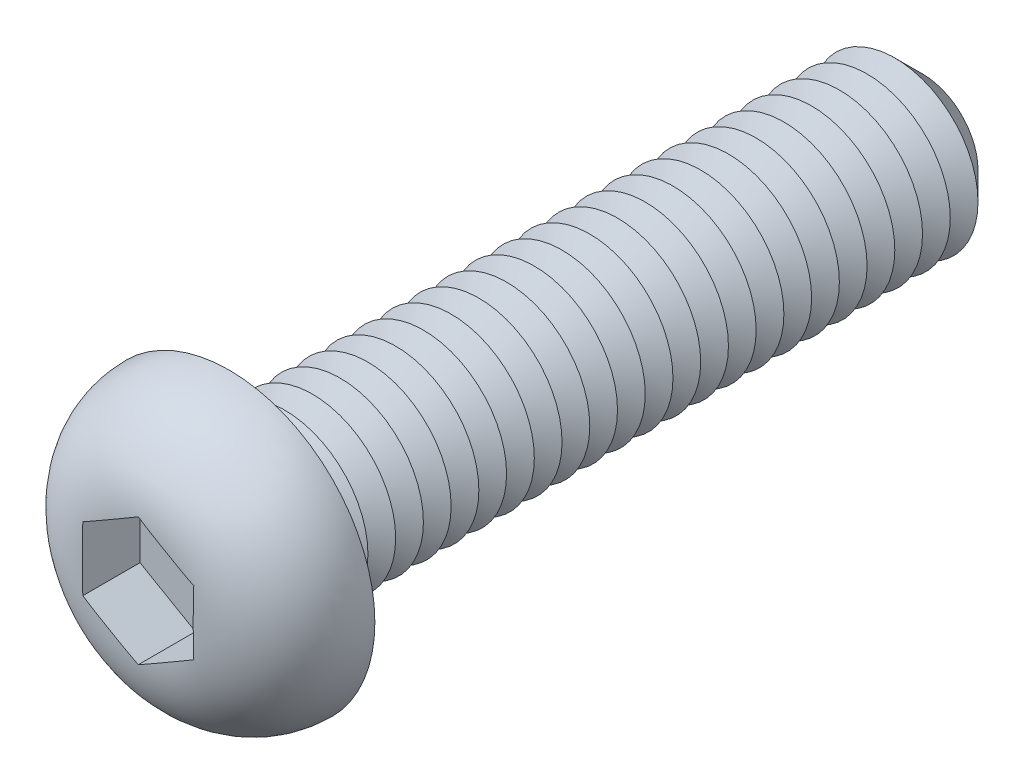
from build123d import *

# Parameters (mm, degrees)
CUT_EXTRUDE1_DEPTH  = 2.08
SKETCH4_R           = 3
BOSS_EXTRUDE1_DEPTH = 25
CHAMFER1_SIZE       = 1
LPATTERN1_COUNT     = 23
LPATTERN1_PITCH     = 1
FILLET2_R           = 0.5
SKETCH6_R           = 0.8
CUT_EXTRUDE2_DEPTH  = 26.22


with BuildPart() as part:
    # Sketch2 → Revolve1 (revolve)
    with BuildSketch(Plane(origin=(0, 0, 0), x_dir=(0, 0, -1), z_dir=(1, 0, 0)), mode=Mode.PRIVATE) as revolve1_sk:
        with BuildLine():
            Line((0, 0), (-3.3, 0))
            Line((-3.3, 0), (-3.3, 1.95))
            ThreePointArc((-3.3, 1.95), (-2.333452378, 4.283452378), (0, 5.25))
            Line((0, 5.25), (0, 0))
        make_face()
    revolve(revolve1_sk.sketch.rotate(Axis((0, 0, 47.934239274), (0, 0, -1)), 90), axis=Axis((0, 0, 47.934239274), (0, 0, -1)))

    # Sketch3 → Cut-Extrude1 (cut)
    with BuildSketch(Plane.XY.offset(3.3)):
        Polygon((0, 2.309401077), (-2, 1.154700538), (-2, -1.154700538), (0, -2.309401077), (2, -1.154700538), (2, 1.154700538), align=None)
    extrude(amount=-CUT_EXTRUDE1_DEPTH, mode=Mode.SUBTRACT)

    # Sketch4 → Boss-Extrude1 (add)
    with BuildSketch(Plane(origin=(0, 0, 0), x_dir=(-1, 0, 0), z_dir=(0, 0, -1))):
        with Locations(Location((0, 0, 0), (0, 0, 180))):
            Circle(SKETCH4_R)
    extrude(amount=BOSS_EXTRUDE1_DEPTH)

    # Chamfer1
    chamfer1_edges = [part.edges().sort_by_distance(p)[0] for p in [
        (-3, 0, -25),
    ]]
    chamfer(chamfer1_edges, length=CHAMFER1_SIZE)

    # Sketch5 → Cut-Revolve1 (revolve, cut)
    with BuildSketch(Plane(origin=(0, 0, 0), x_dir=(0, 0, -1), z_dir=(1, 0, 0)), mode=Mode.PRIVATE) as cut_revolve1_sk:
        Polygon((1, 3), (2, 3), (1.5, 2.133974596), align=None)
    cut_revolve1 = revolve(cut_revolve1_sk.sketch.rotate(Axis((0, 0, 47.934239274), (0, 0, -1)), 90), axis=Axis((0, 0, 47.934239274), (0, 0, -1)), mode=Mode.SUBTRACT)

    # LPattern1: Cut-Revolve1 ×23
    with Locations(*[(0, 0, -i * LPATTERN1_PITCH) for i in range(1, LPATTERN1_COUNT)]):
        add(cut_revolve1, mode=Mode.SUBTRACT)

    # Fillet2
    fillet2_edges = [part.edges().sort_by_distance(p)[0] for p in [
        (-3, 0, 0),
    ]]
    fillet(fillet2_edges, radius=FILLET2_R)

    # Sketch6 → Cut-Extrude2 (cut)
    with BuildSketch(Plane.XY.offset(1.22)):
        Circle(SKETCH6_R)
    extrude(amount=-CUT_EXTRUDE2_DEPTH, mode=Mode.SUBTRACT)


solid = part.part
